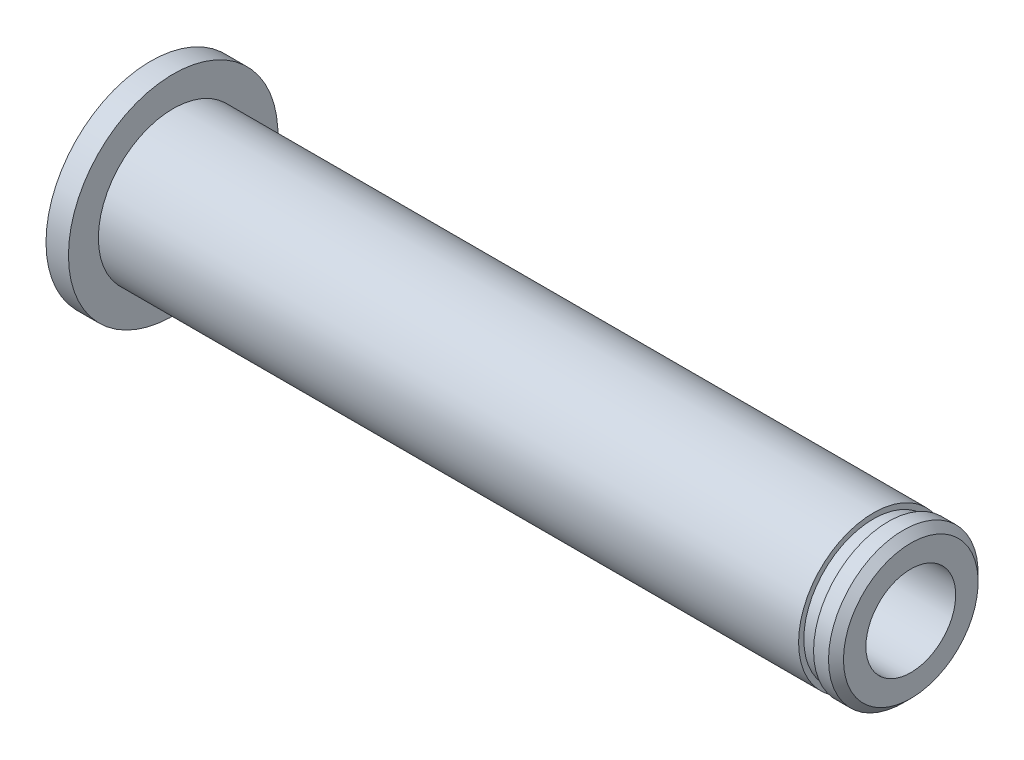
ISO-10303-21;
HEADER;
FILE_DESCRIPTION(('STEP AP214'),'2;1');
FILE_NAME('part.step','',(''),(''),'','','');
FILE_SCHEMA(('AUTOMOTIVE_DESIGN { 1 0 10303 214 1 1 1 1 }'));
ENDSEC;
DATA;
#1=APPLICATION_CONTEXT('core data for automotive mechanical design processes');
#2=APPLICATION_PROTOCOL_DEFINITION('international standard','automotive_design',2000,#1);
#3=PRODUCT_CONTEXT('',#1,'mechanical');
#4=PRODUCT('Part','Part','',(#3));
#5=PRODUCT_RELATED_PRODUCT_CATEGORY('part','',(#4));
#6=PRODUCT_DEFINITION_FORMATION('','',#4);
#7=PRODUCT_DEFINITION_CONTEXT('part definition',#1,'design');
#8=PRODUCT_DEFINITION('design','',#6,#7);
#9=PRODUCT_DEFINITION_SHAPE('','',#8);
#10=(LENGTH_UNIT() NAMED_UNIT(*) SI_UNIT(.MILLI.,.METRE.));
#11=(NAMED_UNIT(*) PLANE_ANGLE_UNIT() SI_UNIT($,.RADIAN.));
#12=(NAMED_UNIT(*) SI_UNIT($,.STERADIAN.) SOLID_ANGLE_UNIT());
#13=UNCERTAINTY_MEASURE_WITH_UNIT(LENGTH_MEASURE(1.E-05),#10,'distance_accuracy_value','');
#14=(GEOMETRIC_REPRESENTATION_CONTEXT(3) GLOBAL_UNCERTAINTY_ASSIGNED_CONTEXT((#13)) GLOBAL_UNIT_ASSIGNED_CONTEXT((#10,
#11,#12)) REPRESENTATION_CONTEXT('',''));
#15=CARTESIAN_POINT('',(0.,0.,0.));
#16=DIRECTION('',(0.,0.,1.));
#17=DIRECTION('',(1.,0.,0.));
#18=AXIS2_PLACEMENT_3D('',#15,#16,#17);
#19=CARTESIAN_POINT('',(0.,0.,0.));
#20=DIRECTION('',(-1.,0.,0.));
#21=DIRECTION('',(0.,0.,1.));
#22=AXIS2_PLACEMENT_3D('',#19,#20,#21);
#23=CYLINDRICAL_SURFACE('',#22,3.);
#24=CARTESIAN_POINT('',(50.8,0.,0.));
#25=DIRECTION('',(-1.,0.,0.));
#26=DIRECTION('',(0.,0.,1.));
#27=AXIS2_PLACEMENT_3D('',#24,#25,#26);
#28=CIRCLE('',#27,3.);
#29=CARTESIAN_POINT('',(50.8,0.,3.));
#30=VERTEX_POINT('',#29);
#31=EDGE_CURVE('E83',#30,#30,#28,.T.);
#32=ORIENTED_EDGE('',*,*,#31,.F.);
#33=EDGE_LOOP('',(#32));
#34=FACE_BOUND('',#33,.T.);
#35=CARTESIAN_POINT('',(0.,0.,0.));
#36=DIRECTION('',(-1.,0.,0.));
#37=DIRECTION('',(0.,0.,1.));
#38=AXIS2_PLACEMENT_3D('',#35,#36,#37);
#39=CIRCLE('',#38,2.99999999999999);
#40=CARTESIAN_POINT('',(0.,0.,2.99999999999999));
#41=VERTEX_POINT('',#40);
#42=EDGE_CURVE('E10',#41,#41,#39,.T.);
#43=ORIENTED_EDGE('',*,*,#42,.T.);
#44=EDGE_LOOP('',(#43));
#45=FACE_BOUND('',#44,.T.);
#46=ADVANCED_FACE('F34',(#34,#45),#23,.F.);
#47=CARTESIAN_POINT('',(0.,2.99999999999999,0.));
#48=DIRECTION('',(1.,0.,0.));
#49=DIRECTION('',(0.,0.,-1.));
#50=AXIS2_PLACEMENT_3D('',#47,#48,#49);
#51=PLANE('',#50);
#52=ORIENTED_EDGE('',*,*,#42,.F.);
#53=EDGE_LOOP('',(#52));
#54=FACE_BOUND('',#53,.T.);
#55=CARTESIAN_POINT('',(0.,0.,0.));
#56=DIRECTION('',(-1.,0.,0.));
#57=DIRECTION('',(0.,0.,1.));
#58=AXIS2_PLACEMENT_3D('',#55,#56,#57);
#59=CIRCLE('',#58,7.);
#60=CARTESIAN_POINT('',(0.,0.,7.));
#61=VERTEX_POINT('',#60);
#62=EDGE_CURVE('E41',#61,#61,#59,.T.);
#63=ORIENTED_EDGE('',*,*,#62,.T.);
#64=EDGE_LOOP('',(#63));
#65=FACE_BOUND('',#64,.T.);
#66=ADVANCED_FACE('F92',(#54,#65),#51,.F.);
#67=CARTESIAN_POINT('',(0.,0.,0.));
#68=DIRECTION('',(-1.,0.,0.));
#69=DIRECTION('',(0.,0.,1.));
#70=AXIS2_PLACEMENT_3D('',#67,#68,#69);
#71=CYLINDRICAL_SURFACE('',#70,7.);
#72=ORIENTED_EDGE('',*,*,#62,.F.);
#73=EDGE_LOOP('',(#72));
#74=FACE_BOUND('',#73,.T.);
#75=CARTESIAN_POINT('',(1.5,0.,0.));
#76=DIRECTION('',(-1.,0.,0.));
#77=DIRECTION('',(0.,0.,1.));
#78=AXIS2_PLACEMENT_3D('',#75,#76,#77);
#79=CIRCLE('',#78,7.);
#80=CARTESIAN_POINT('',(1.5,0.,7.));
#81=VERTEX_POINT('',#80);
#82=EDGE_CURVE('E47',#81,#81,#79,.T.);
#83=ORIENTED_EDGE('',*,*,#82,.T.);
#84=EDGE_LOOP('',(#83));
#85=FACE_BOUND('',#84,.T.);
#86=ADVANCED_FACE('F96',(#74,#85),#71,.T.);
#87=CARTESIAN_POINT('',(1.5,7.,0.));
#88=DIRECTION('',(-1.,0.,0.));
#89=DIRECTION('',(0.,0.,1.));
#90=AXIS2_PLACEMENT_3D('',#87,#88,#89);
#91=PLANE('',#90);
#92=ORIENTED_EDGE('',*,*,#82,.F.);
#93=EDGE_LOOP('',(#92));
#94=FACE_BOUND('',#93,.T.);
#95=CARTESIAN_POINT('',(1.5,0.,0.));
#96=DIRECTION('',(-1.,0.,0.));
#97=DIRECTION('',(0.,0.,1.));
#98=AXIS2_PLACEMENT_3D('',#95,#96,#97);
#99=CIRCLE('',#98,5.);
#100=CARTESIAN_POINT('',(1.5,0.,5.));
#101=VERTEX_POINT('',#100);
#102=EDGE_CURVE('E53',#101,#101,#99,.T.);
#103=ORIENTED_EDGE('',*,*,#102,.T.);
#104=EDGE_LOOP('',(#103));
#105=FACE_BOUND('',#104,.T.);
#106=ADVANCED_FACE('F101',(#94,#105),#91,.F.);
#107=CARTESIAN_POINT('',(0.,0.,0.));
#108=DIRECTION('',(-1.,0.,0.));
#109=DIRECTION('',(0.,0.,1.));
#110=AXIS2_PLACEMENT_3D('',#107,#108,#109);
#111=CYLINDRICAL_SURFACE('',#110,5.);
#112=ORIENTED_EDGE('',*,*,#102,.F.);
#113=EDGE_LOOP('',(#112));
#114=FACE_BOUND('',#113,.T.);
#115=CARTESIAN_POINT('',(48.3,0.,0.));
#116=DIRECTION('',(-1.,0.,0.));
#117=DIRECTION('',(0.,0.,1.));
#118=AXIS2_PLACEMENT_3D('',#115,#116,#117);
#119=CIRCLE('',#118,5.);
#120=CARTESIAN_POINT('',(48.3,0.,5.));
#121=VERTEX_POINT('',#120);
#122=EDGE_CURVE('E59',#121,#121,#119,.T.);
#123=ORIENTED_EDGE('',*,*,#122,.T.);
#124=EDGE_LOOP('',(#123));
#125=FACE_BOUND('',#124,.T.);
#126=ADVANCED_FACE('F107',(#114,#125),#111,.T.);
#127=CARTESIAN_POINT('',(48.3,5.,0.));
#128=DIRECTION('',(-1.,0.,0.));
#129=DIRECTION('',(0.,0.,1.));
#130=AXIS2_PLACEMENT_3D('',#127,#128,#129);
#131=PLANE('',#130);
#132=ORIENTED_EDGE('',*,*,#122,.F.);
#133=EDGE_LOOP('',(#132));
#134=FACE_BOUND('',#133,.T.);
#135=CARTESIAN_POINT('',(48.3,0.,0.));
#136=DIRECTION('',(-1.,0.,0.));
#137=DIRECTION('',(0.,0.,1.));
#138=AXIS2_PLACEMENT_3D('',#135,#136,#137);
#139=CIRCLE('',#138,4.65);
#140=CARTESIAN_POINT('',(48.3,0.,4.65));
#141=VERTEX_POINT('',#140);
#142=EDGE_CURVE('E63',#141,#141,#139,.T.);
#143=ORIENTED_EDGE('',*,*,#142,.T.);
#144=EDGE_LOOP('',(#143));
#145=FACE_BOUND('',#144,.T.);
#146=ADVANCED_FACE('F111',(#134,#145),#131,.F.);
#147=CARTESIAN_POINT('',(0.,0.,0.));
#148=DIRECTION('',(-1.,0.,0.));
#149=DIRECTION('',(0.,0.,1.));
#150=AXIS2_PLACEMENT_3D('',#147,#148,#149);
#151=CYLINDRICAL_SURFACE('',#150,4.65);
#152=ORIENTED_EDGE('',*,*,#142,.F.);
#153=EDGE_LOOP('',(#152));
#154=FACE_BOUND('',#153,.T.);
#155=CARTESIAN_POINT('',(49.3,0.,0.));
#156=DIRECTION('',(-1.,0.,0.));
#157=DIRECTION('',(0.,0.,1.));
#158=AXIS2_PLACEMENT_3D('',#155,#156,#157);
#159=CIRCLE('',#158,4.65);
#160=CARTESIAN_POINT('',(49.3,0.,4.65));
#161=VERTEX_POINT('',#160);
#162=EDGE_CURVE('E67',#161,#161,#159,.T.);
#163=ORIENTED_EDGE('',*,*,#162,.T.);
#164=EDGE_LOOP('',(#163));
#165=FACE_BOUND('',#164,.T.);
#166=ADVANCED_FACE('F115',(#154,#165),#151,.T.);
#167=CARTESIAN_POINT('',(49.3,4.65,0.));
#168=DIRECTION('',(1.,0.,0.));
#169=DIRECTION('',(0.,0.,-1.));
#170=AXIS2_PLACEMENT_3D('',#167,#168,#169);
#171=PLANE('',#170);
#172=ORIENTED_EDGE('',*,*,#162,.F.);
#173=EDGE_LOOP('',(#172));
#174=FACE_BOUND('',#173,.T.);
#175=CARTESIAN_POINT('',(49.3,0.,0.));
#176=DIRECTION('',(-1.,0.,0.));
#177=DIRECTION('',(0.,0.,1.));
#178=AXIS2_PLACEMENT_3D('',#175,#176,#177);
#179=CIRCLE('',#178,5.);
#180=CARTESIAN_POINT('',(49.3,0.,5.));
#181=VERTEX_POINT('',#180);
#182=EDGE_CURVE('E71',#181,#181,#179,.T.);
#183=ORIENTED_EDGE('',*,*,#182,.T.);
#184=EDGE_LOOP('',(#183));
#185=FACE_BOUND('',#184,.T.);
#186=ADVANCED_FACE('F119',(#174,#185),#171,.F.);
#187=CARTESIAN_POINT('',(0.,0.,0.));
#188=DIRECTION('',(-1.,0.,0.));
#189=DIRECTION('',(0.,0.,1.));
#190=AXIS2_PLACEMENT_3D('',#187,#188,#189);
#191=CYLINDRICAL_SURFACE('',#190,5.);
#192=ORIENTED_EDGE('',*,*,#182,.F.);
#193=EDGE_LOOP('',(#192));
#194=FACE_BOUND('',#193,.T.);
#195=CARTESIAN_POINT('',(50.3,0.,0.));
#196=DIRECTION('',(-1.,0.,0.));
#197=DIRECTION('',(0.,0.,1.));
#198=AXIS2_PLACEMENT_3D('',#195,#196,#197);
#199=CIRCLE('',#198,5.);
#200=CARTESIAN_POINT('',(50.3,0.,5.));
#201=VERTEX_POINT('',#200);
#202=EDGE_CURVE('E75',#201,#201,#199,.T.);
#203=ORIENTED_EDGE('',*,*,#202,.T.);
#204=EDGE_LOOP('',(#203));
#205=FACE_BOUND('',#204,.T.);
#206=ADVANCED_FACE('F123',(#194,#205),#191,.T.);
#207=CARTESIAN_POINT('',(50.8,0.,0.));
#208=DIRECTION('',(-1.,0.,0.));
#209=DIRECTION('',(0.,0.,1.));
#210=AXIS2_PLACEMENT_3D('',#207,#208,#209);
#211=CONICAL_SURFACE('',#210,4.5,0.785398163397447);
#212=ORIENTED_EDGE('',*,*,#202,.F.);
#213=EDGE_LOOP('',(#212));
#214=FACE_BOUND('',#213,.T.);
#215=CARTESIAN_POINT('',(50.8,0.,0.));
#216=DIRECTION('',(-1.,0.,0.));
#217=DIRECTION('',(0.,0.,1.));
#218=AXIS2_PLACEMENT_3D('',#215,#216,#217);
#219=CIRCLE('',#218,4.5);
#220=CARTESIAN_POINT('',(50.8,0.,4.5));
#221=VERTEX_POINT('',#220);
#222=EDGE_CURVE('E79',#221,#221,#219,.T.);
#223=ORIENTED_EDGE('',*,*,#222,.T.);
#224=EDGE_LOOP('',(#223));
#225=FACE_BOUND('',#224,.T.);
#226=ADVANCED_FACE('F127',(#214,#225),#211,.T.);
#227=CARTESIAN_POINT('',(50.8,4.5,0.));
#228=DIRECTION('',(-1.,0.,0.));
#229=DIRECTION('',(0.,0.,1.));
#230=AXIS2_PLACEMENT_3D('',#227,#228,#229);
#231=PLANE('',#230);
#232=ORIENTED_EDGE('',*,*,#222,.F.);
#233=EDGE_LOOP('',(#232));
#234=FACE_BOUND('',#233,.T.);
#235=ORIENTED_EDGE('',*,*,#31,.T.);
#236=EDGE_LOOP('',(#235));
#237=FACE_BOUND('',#236,.T.);
#238=ADVANCED_FACE('F89',(#234,#237),#231,.F.);
#239=CLOSED_SHELL('',(#46,#66,#86,#106,#126,#146,#166,#186,#206,#226,#238));
#240=MANIFOLD_SOLID_BREP('B2',#239);
#241=ADVANCED_BREP_SHAPE_REPRESENTATION('',(#18,#240),#14);
#242=SHAPE_DEFINITION_REPRESENTATION(#9,#241);
ENDSEC;
END-ISO-10303-21;
